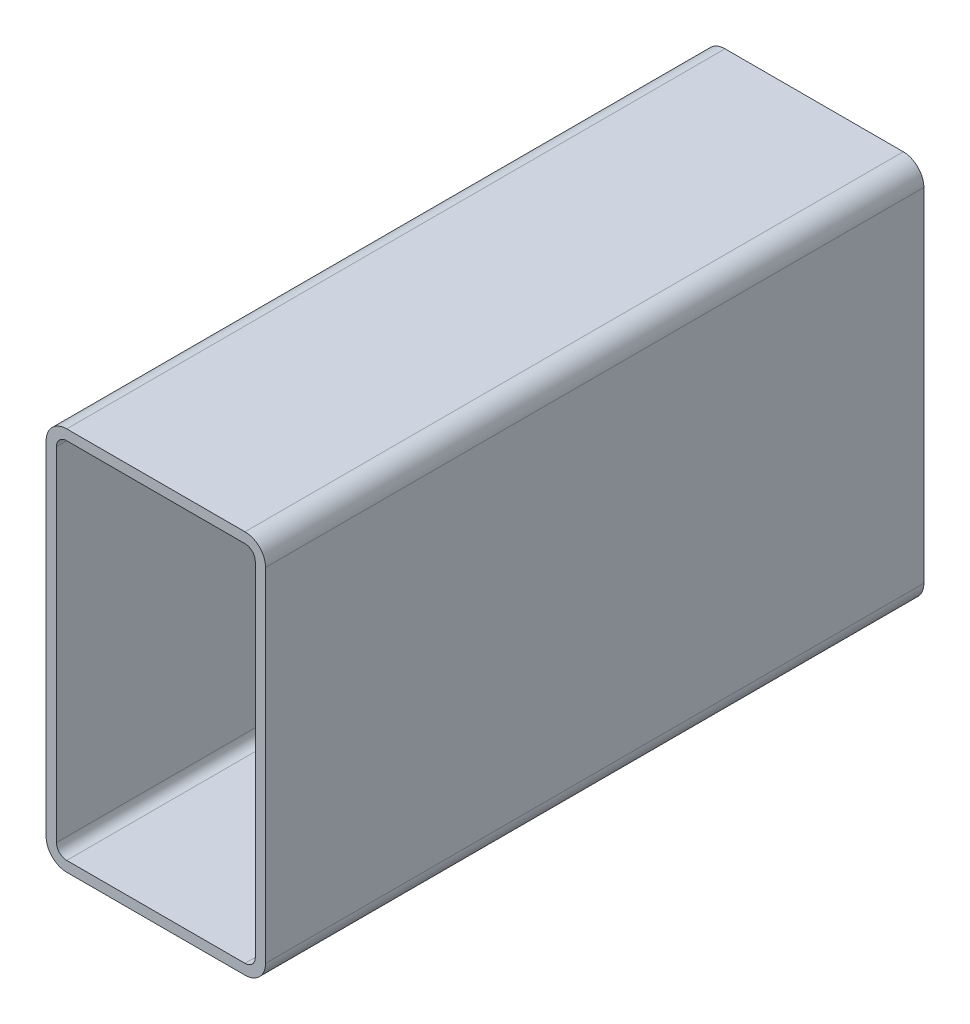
ISO-10303-21;
HEADER;
FILE_DESCRIPTION(('STEP AP214'),'2;1');
FILE_NAME('part.step','',(''),(''),'','','');
FILE_SCHEMA(('AUTOMOTIVE_DESIGN { 1 0 10303 214 1 1 1 1 }'));
ENDSEC;
DATA;
#1=APPLICATION_CONTEXT('core data for automotive mechanical design processes');
#2=APPLICATION_PROTOCOL_DEFINITION('international standard','automotive_design',2000,#1);
#3=PRODUCT_CONTEXT('',#1,'mechanical');
#4=PRODUCT('Part','Part','',(#3));
#5=PRODUCT_RELATED_PRODUCT_CATEGORY('part','',(#4));
#6=PRODUCT_DEFINITION_FORMATION('','',#4);
#7=PRODUCT_DEFINITION_CONTEXT('part definition',#1,'design');
#8=PRODUCT_DEFINITION('design','',#6,#7);
#9=PRODUCT_DEFINITION_SHAPE('','',#8);
#10=(LENGTH_UNIT() NAMED_UNIT(*) SI_UNIT(.MILLI.,.METRE.));
#11=(NAMED_UNIT(*) PLANE_ANGLE_UNIT() SI_UNIT($,.RADIAN.));
#12=(NAMED_UNIT(*) SI_UNIT($,.STERADIAN.) SOLID_ANGLE_UNIT());
#13=UNCERTAINTY_MEASURE_WITH_UNIT(LENGTH_MEASURE(1.E-05),#10,'distance_accuracy_value','');
#14=(GEOMETRIC_REPRESENTATION_CONTEXT(3) GLOBAL_UNCERTAINTY_ASSIGNED_CONTEXT((#13)) GLOBAL_UNIT_ASSIGNED_CONTEXT((#10,
#11,#12)) REPRESENTATION_CONTEXT('',''));
#15=CARTESIAN_POINT('',(0.,0.,0.));
#16=DIRECTION('',(0.,0.,1.));
#17=DIRECTION('',(1.,0.,0.));
#18=AXIS2_PLACEMENT_3D('',#15,#16,#17);
#19=CARTESIAN_POINT('',(11.2001778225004,170.264039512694,304.8));
#20=DIRECTION('',(0.,0.,1.));
#21=DIRECTION('',(1.,0.,0.));
#22=AXIS2_PLACEMENT_3D('',#19,#20,#21);
#23=PLANE('',#22);
#24=CARTESIAN_POINT('',(11.2001778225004,170.264039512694,304.8));
#25=DIRECTION('',(0.,0.,1.));
#26=DIRECTION('',(1.,0.,0.));
#27=AXIS2_PLACEMENT_3D('',#24,#25,#26);
#28=CIRCLE('',#27,9.525);
#29=CARTESIAN_POINT('',(11.2001778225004,179.789039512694,304.8));
#30=VERTEX_POINT('',#29);
#31=CARTESIAN_POINT('',(1.67517782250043,170.264039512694,304.8));
#32=VERTEX_POINT('',#31);
#33=EDGE_CURVE('E211',#30,#32,#28,.T.);
#34=ORIENTED_EDGE('',*,*,#33,.T.);
#35=DIRECTION('',(0.,-1.,0.));
#36=VECTOR('',#35,1.);
#37=CARTESIAN_POINT('',(1.67517782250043,11.5140395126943,304.8));
#38=LINE('',#37,#36);
#39=CARTESIAN_POINT('',(1.67517782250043,11.5140395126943,304.8));
#40=VERTEX_POINT('',#39);
#41=EDGE_CURVE('E214',#32,#40,#38,.T.);
#42=ORIENTED_EDGE('',*,*,#41,.T.);
#43=CARTESIAN_POINT('',(11.2001778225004,11.5140395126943,304.8));
#44=DIRECTION('',(0.,0.,1.));
#45=DIRECTION('',(1.,0.,0.));
#46=AXIS2_PLACEMENT_3D('',#43,#44,#45);
#47=CIRCLE('',#46,9.525);
#48=CARTESIAN_POINT('',(11.2001778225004,1.98903951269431,304.8));
#49=VERTEX_POINT('',#48);
#50=EDGE_CURVE('E217',#40,#49,#47,.T.);
#51=ORIENTED_EDGE('',*,*,#50,.T.);
#52=DIRECTION('',(1.,0.,0.));
#53=VECTOR('',#52,1.);
#54=CARTESIAN_POINT('',(93.7501778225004,1.98903951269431,304.8));
#55=LINE('',#54,#53);
#56=CARTESIAN_POINT('',(93.7501778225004,1.98903951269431,304.8));
#57=VERTEX_POINT('',#56);
#58=EDGE_CURVE('E219',#49,#57,#55,.T.);
#59=ORIENTED_EDGE('',*,*,#58,.T.);
#60=CARTESIAN_POINT('',(93.7501778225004,11.5140395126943,304.8));
#61=DIRECTION('',(0.,0.,1.));
#62=DIRECTION('',(1.,0.,0.));
#63=AXIS2_PLACEMENT_3D('',#60,#61,#62);
#64=CIRCLE('',#63,9.52500000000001);
#65=CARTESIAN_POINT('',(103.2751778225,11.5140395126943,304.8));
#66=VERTEX_POINT('',#65);
#67=EDGE_CURVE('E221',#57,#66,#64,.T.);
#68=ORIENTED_EDGE('',*,*,#67,.T.);
#69=DIRECTION('',(0.,1.,0.));
#70=VECTOR('',#69,1.);
#71=CARTESIAN_POINT('',(103.2751778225,170.264039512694,304.8));
#72=LINE('',#71,#70);
#73=CARTESIAN_POINT('',(103.2751778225,170.264039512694,304.8));
#74=VERTEX_POINT('',#73);
#75=EDGE_CURVE('E223',#66,#74,#72,.T.);
#76=ORIENTED_EDGE('',*,*,#75,.T.);
#77=CARTESIAN_POINT('',(93.7501778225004,170.264039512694,304.8));
#78=DIRECTION('',(0.,0.,1.));
#79=DIRECTION('',(1.,0.,0.));
#80=AXIS2_PLACEMENT_3D('',#77,#78,#79);
#81=CIRCLE('',#80,9.525);
#82=CARTESIAN_POINT('',(93.7501778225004,179.789039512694,304.8));
#83=VERTEX_POINT('',#82);
#84=EDGE_CURVE('E225',#74,#83,#81,.T.);
#85=ORIENTED_EDGE('',*,*,#84,.T.);
#86=DIRECTION('',(-1.,0.,0.));
#87=VECTOR('',#86,1.);
#88=CARTESIAN_POINT('',(11.2001778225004,179.789039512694,304.8));
#89=LINE('',#88,#87);
#90=EDGE_CURVE('E227',#83,#30,#89,.T.);
#91=ORIENTED_EDGE('',*,*,#90,.T.);
#92=EDGE_LOOP('',(#34,#42,#51,#59,#68,#76,#85,#91));
#93=FACE_BOUND('',#92,.T.);
#94=DIRECTION('',(0.,-1.,0.));
#95=VECTOR('',#94,1.);
#96=CARTESIAN_POINT('',(6.43767782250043,11.5140395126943,304.8));
#97=LINE('',#96,#95);
#98=CARTESIAN_POINT('',(6.43767782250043,170.264039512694,304.8));
#99=VERTEX_POINT('',#98);
#100=CARTESIAN_POINT('',(6.43767782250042,11.5140395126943,304.8));
#101=VERTEX_POINT('',#100);
#102=EDGE_CURVE('E154',#99,#101,#97,.T.);
#103=ORIENTED_EDGE('',*,*,#102,.F.);
#104=CARTESIAN_POINT('',(11.2001778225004,170.264039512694,304.8));
#105=DIRECTION('',(0.,0.,1.));
#106=DIRECTION('',(1.,0.,0.));
#107=AXIS2_PLACEMENT_3D('',#104,#105,#106);
#108=CIRCLE('',#107,4.7625);
#109=CARTESIAN_POINT('',(11.2001778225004,175.026539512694,304.8));
#110=VERTEX_POINT('',#109);
#111=EDGE_CURVE('E146',#110,#99,#108,.T.);
#112=ORIENTED_EDGE('',*,*,#111,.F.);
#113=DIRECTION('',(-1.,0.,0.));
#114=VECTOR('',#113,1.);
#115=CARTESIAN_POINT('',(11.2001778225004,175.026539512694,304.8));
#116=LINE('',#115,#114);
#117=CARTESIAN_POINT('',(93.7501778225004,175.026539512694,304.8));
#118=VERTEX_POINT('',#117);
#119=EDGE_CURVE('E179',#118,#110,#116,.T.);
#120=ORIENTED_EDGE('',*,*,#119,.F.);
#121=CARTESIAN_POINT('',(93.7501778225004,170.264039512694,304.8));
#122=DIRECTION('',(0.,0.,1.));
#123=DIRECTION('',(1.,0.,0.));
#124=AXIS2_PLACEMENT_3D('',#121,#122,#123);
#125=CIRCLE('',#124,4.7625);
#126=CARTESIAN_POINT('',(98.5126778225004,170.264039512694,304.8));
#127=VERTEX_POINT('',#126);
#128=EDGE_CURVE('E177',#127,#118,#125,.T.);
#129=ORIENTED_EDGE('',*,*,#128,.F.);
#130=DIRECTION('',(0.,1.,0.));
#131=VECTOR('',#130,1.);
#132=CARTESIAN_POINT('',(98.5126778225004,170.264039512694,304.8));
#133=LINE('',#132,#131);
#134=CARTESIAN_POINT('',(98.5126778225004,11.5140395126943,304.8));
#135=VERTEX_POINT('',#134);
#136=EDGE_CURVE('E175',#135,#127,#133,.T.);
#137=ORIENTED_EDGE('',*,*,#136,.F.);
#138=CARTESIAN_POINT('',(93.7501778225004,11.5140395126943,304.8));
#139=DIRECTION('',(0.,0.,1.));
#140=DIRECTION('',(1.,0.,0.));
#141=AXIS2_PLACEMENT_3D('',#138,#139,#140);
#142=CIRCLE('',#141,4.7625);
#143=CARTESIAN_POINT('',(93.7501778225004,6.75153951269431,304.8));
#144=VERTEX_POINT('',#143);
#145=EDGE_CURVE('E173',#144,#135,#142,.T.);
#146=ORIENTED_EDGE('',*,*,#145,.F.);
#147=DIRECTION('',(1.,0.,0.));
#148=VECTOR('',#147,1.);
#149=CARTESIAN_POINT('',(93.7501778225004,6.75153951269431,304.8));
#150=LINE('',#149,#148);
#151=CARTESIAN_POINT('',(11.2001778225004,6.75153951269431,304.8));
#152=VERTEX_POINT('',#151);
#153=EDGE_CURVE('E169',#152,#144,#150,.T.);
#154=ORIENTED_EDGE('',*,*,#153,.F.);
#155=CARTESIAN_POINT('',(11.2001778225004,11.5140395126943,304.8));
#156=DIRECTION('',(0.,0.,1.));
#157=DIRECTION('',(1.,0.,0.));
#158=AXIS2_PLACEMENT_3D('',#155,#156,#157);
#159=CIRCLE('',#158,4.7625);
#160=EDGE_CURVE('E167',#101,#152,#159,.T.);
#161=ORIENTED_EDGE('',*,*,#160,.F.);
#162=EDGE_LOOP('',(#103,#112,#120,#129,#137,#146,#154,#161));
#163=FACE_BOUND('',#162,.T.);
#164=ADVANCED_FACE('F33',(#93,#163),#23,.T.);
#165=CARTESIAN_POINT('',(11.2001778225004,170.264039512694,0.));
#166=DIRECTION('',(0.,0.,1.));
#167=DIRECTION('',(1.,0.,0.));
#168=AXIS2_PLACEMENT_3D('',#165,#166,#167);
#169=PLANE('',#168);
#170=CARTESIAN_POINT('',(11.2001778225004,170.264039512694,0.));
#171=DIRECTION('',(0.,0.,1.));
#172=DIRECTION('',(1.,0.,0.));
#173=AXIS2_PLACEMENT_3D('',#170,#171,#172);
#174=CIRCLE('',#173,9.525);
#175=CARTESIAN_POINT('',(11.2001778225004,179.789039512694,0.));
#176=VERTEX_POINT('',#175);
#177=CARTESIAN_POINT('',(1.67517782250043,170.264039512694,0.));
#178=VERTEX_POINT('',#177);
#179=EDGE_CURVE('E162',#176,#178,#174,.T.);
#180=ORIENTED_EDGE('',*,*,#179,.F.);
#181=DIRECTION('',(-1.,0.,0.));
#182=VECTOR('',#181,1.);
#183=CARTESIAN_POINT('',(11.2001778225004,179.789039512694,0.));
#184=LINE('',#183,#182);
#185=CARTESIAN_POINT('',(93.7501778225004,179.789039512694,0.));
#186=VERTEX_POINT('',#185);
#187=EDGE_CURVE('E215',#186,#176,#184,.T.);
#188=ORIENTED_EDGE('',*,*,#187,.F.);
#189=CARTESIAN_POINT('',(93.7501778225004,170.264039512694,0.));
#190=DIRECTION('',(0.,0.,1.));
#191=DIRECTION('',(1.,0.,0.));
#192=AXIS2_PLACEMENT_3D('',#189,#190,#191);
#193=CIRCLE('',#192,9.525);
#194=CARTESIAN_POINT('',(103.2751778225,170.264039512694,0.));
#195=VERTEX_POINT('',#194);
#196=EDGE_CURVE('E242',#195,#186,#193,.T.);
#197=ORIENTED_EDGE('',*,*,#196,.F.);
#198=DIRECTION('',(0.,1.,0.));
#199=VECTOR('',#198,1.);
#200=CARTESIAN_POINT('',(103.2751778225,170.264039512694,0.));
#201=LINE('',#200,#199);
#202=CARTESIAN_POINT('',(103.2751778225,11.5140395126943,0.));
#203=VERTEX_POINT('',#202);
#204=EDGE_CURVE('E240',#203,#195,#201,.T.);
#205=ORIENTED_EDGE('',*,*,#204,.F.);
#206=CARTESIAN_POINT('',(93.7501778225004,11.5140395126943,0.));
#207=DIRECTION('',(0.,0.,1.));
#208=DIRECTION('',(1.,0.,0.));
#209=AXIS2_PLACEMENT_3D('',#206,#207,#208);
#210=CIRCLE('',#209,9.52500000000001);
#211=CARTESIAN_POINT('',(93.7501778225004,1.98903951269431,0.));
#212=VERTEX_POINT('',#211);
#213=EDGE_CURVE('E238',#212,#203,#210,.T.);
#214=ORIENTED_EDGE('',*,*,#213,.F.);
#215=DIRECTION('',(1.,0.,0.));
#216=VECTOR('',#215,1.);
#217=CARTESIAN_POINT('',(93.7501778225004,1.98903951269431,0.));
#218=LINE('',#217,#216);
#219=CARTESIAN_POINT('',(11.2001778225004,1.98903951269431,0.));
#220=VERTEX_POINT('',#219);
#221=EDGE_CURVE('E236',#220,#212,#218,.T.);
#222=ORIENTED_EDGE('',*,*,#221,.F.);
#223=CARTESIAN_POINT('',(11.2001778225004,11.5140395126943,0.));
#224=DIRECTION('',(0.,0.,1.));
#225=DIRECTION('',(1.,0.,0.));
#226=AXIS2_PLACEMENT_3D('',#223,#224,#225);
#227=CIRCLE('',#226,9.525);
#228=CARTESIAN_POINT('',(1.67517782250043,11.5140395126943,0.));
#229=VERTEX_POINT('',#228);
#230=EDGE_CURVE('E234',#229,#220,#227,.T.);
#231=ORIENTED_EDGE('',*,*,#230,.F.);
#232=DIRECTION('',(0.,-1.,0.));
#233=VECTOR('',#232,1.);
#234=CARTESIAN_POINT('',(1.67517782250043,11.5140395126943,0.));
#235=LINE('',#234,#233);
#236=EDGE_CURVE('E232',#178,#229,#235,.T.);
#237=ORIENTED_EDGE('',*,*,#236,.F.);
#238=EDGE_LOOP('',(#180,#188,#197,#205,#214,#222,#231,#237));
#239=FACE_BOUND('',#238,.T.);
#240=CARTESIAN_POINT('',(11.2001778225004,170.264039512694,0.));
#241=DIRECTION('',(0.,0.,1.));
#242=DIRECTION('',(1.,0.,0.));
#243=AXIS2_PLACEMENT_3D('',#240,#241,#242);
#244=CIRCLE('',#243,4.7625);
#245=CARTESIAN_POINT('',(11.2001778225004,175.026539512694,0.));
#246=VERTEX_POINT('',#245);
#247=CARTESIAN_POINT('',(6.43767782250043,170.264039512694,0.));
#248=VERTEX_POINT('',#247);
#249=EDGE_CURVE('E56',#246,#248,#244,.T.);
#250=ORIENTED_EDGE('',*,*,#249,.T.);
#251=DIRECTION('',(0.,-1.,0.));
#252=VECTOR('',#251,1.);
#253=CARTESIAN_POINT('',(6.43767782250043,11.5140395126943,0.));
#254=LINE('',#253,#252);
#255=CARTESIAN_POINT('',(6.43767782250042,11.5140395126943,0.));
#256=VERTEX_POINT('',#255);
#257=EDGE_CURVE('E161',#248,#256,#254,.T.);
#258=ORIENTED_EDGE('',*,*,#257,.T.);
#259=CARTESIAN_POINT('',(11.2001778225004,11.5140395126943,0.));
#260=DIRECTION('',(0.,0.,1.));
#261=DIRECTION('',(1.,0.,0.));
#262=AXIS2_PLACEMENT_3D('',#259,#260,#261);
#263=CIRCLE('',#262,4.7625);
#264=CARTESIAN_POINT('',(11.2001778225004,6.75153951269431,0.));
#265=VERTEX_POINT('',#264);
#266=EDGE_CURVE('E183',#256,#265,#263,.T.);
#267=ORIENTED_EDGE('',*,*,#266,.T.);
#268=DIRECTION('',(1.,0.,0.));
#269=VECTOR('',#268,1.);
#270=CARTESIAN_POINT('',(93.7501778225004,6.75153951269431,0.));
#271=LINE('',#270,#269);
#272=CARTESIAN_POINT('',(93.7501778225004,6.75153951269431,0.));
#273=VERTEX_POINT('',#272);
#274=EDGE_CURVE('E186',#265,#273,#271,.T.);
#275=ORIENTED_EDGE('',*,*,#274,.T.);
#276=CARTESIAN_POINT('',(93.7501778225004,11.5140395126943,0.));
#277=DIRECTION('',(0.,0.,1.));
#278=DIRECTION('',(1.,0.,0.));
#279=AXIS2_PLACEMENT_3D('',#276,#277,#278);
#280=CIRCLE('',#279,4.7625);
#281=CARTESIAN_POINT('',(98.5126778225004,11.5140395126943,0.));
#282=VERTEX_POINT('',#281);
#283=EDGE_CURVE('E189',#273,#282,#280,.T.);
#284=ORIENTED_EDGE('',*,*,#283,.T.);
#285=DIRECTION('',(0.,1.,0.));
#286=VECTOR('',#285,1.);
#287=CARTESIAN_POINT('',(98.5126778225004,170.264039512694,0.));
#288=LINE('',#287,#286);
#289=CARTESIAN_POINT('',(98.5126778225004,170.264039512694,0.));
#290=VERTEX_POINT('',#289);
#291=EDGE_CURVE('E192',#282,#290,#288,.T.);
#292=ORIENTED_EDGE('',*,*,#291,.T.);
#293=CARTESIAN_POINT('',(93.7501778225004,170.264039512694,0.));
#294=DIRECTION('',(0.,0.,1.));
#295=DIRECTION('',(1.,0.,0.));
#296=AXIS2_PLACEMENT_3D('',#293,#294,#295);
#297=CIRCLE('',#296,4.7625);
#298=CARTESIAN_POINT('',(93.7501778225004,175.026539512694,0.));
#299=VERTEX_POINT('',#298);
#300=EDGE_CURVE('E195',#290,#299,#297,.T.);
#301=ORIENTED_EDGE('',*,*,#300,.T.);
#302=DIRECTION('',(-1.,0.,0.));
#303=VECTOR('',#302,1.);
#304=CARTESIAN_POINT('',(11.2001778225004,175.026539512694,0.));
#305=LINE('',#304,#303);
#306=EDGE_CURVE('E155',#299,#246,#305,.T.);
#307=ORIENTED_EDGE('',*,*,#306,.T.);
#308=EDGE_LOOP('',(#250,#258,#267,#275,#284,#292,#301,#307));
#309=FACE_BOUND('',#308,.T.);
#310=ADVANCED_FACE('F272',(#239,#309),#169,.F.);
#311=CARTESIAN_POINT('',(11.2001778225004,170.264039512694,304.8));
#312=DIRECTION('',(0.,0.,-1.));
#313=DIRECTION('',(-1.,0.,0.));
#314=AXIS2_PLACEMENT_3D('',#311,#312,#313);
#315=CYLINDRICAL_SURFACE('',#314,9.525);
#316=ORIENTED_EDGE('',*,*,#179,.T.);
#317=DIRECTION('',(0.,0.,-1.));
#318=VECTOR('',#317,1.);
#319=CARTESIAN_POINT('',(1.67517782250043,170.264039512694,304.8));
#320=LINE('',#319,#318);
#321=EDGE_CURVE('E11',#32,#178,#320,.T.);
#322=ORIENTED_EDGE('',*,*,#321,.F.);
#323=ORIENTED_EDGE('',*,*,#33,.F.);
#324=DIRECTION('',(0.,0.,-1.));
#325=VECTOR('',#324,1.);
#326=CARTESIAN_POINT('',(11.2001778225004,179.789039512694,304.8));
#327=LINE('',#326,#325);
#328=EDGE_CURVE('E229',#30,#176,#327,.T.);
#329=ORIENTED_EDGE('',*,*,#328,.T.);
#330=EDGE_LOOP('',(#316,#322,#323,#329));
#331=FACE_BOUND('',#330,.T.);
#332=ADVANCED_FACE('F35',(#331),#315,.T.);
#333=CARTESIAN_POINT('',(1.67517782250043,11.5140395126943,304.8));
#334=DIRECTION('',(1.,0.,0.));
#335=DIRECTION('',(0.,0.,-1.));
#336=AXIS2_PLACEMENT_3D('',#333,#334,#335);
#337=PLANE('',#336);
#338=ORIENTED_EDGE('',*,*,#236,.T.);
#339=DIRECTION('',(0.,0.,-1.));
#340=VECTOR('',#339,1.);
#341=CARTESIAN_POINT('',(1.67517782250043,11.5140395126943,304.8));
#342=LINE('',#341,#340);
#343=EDGE_CURVE('E41',#40,#229,#342,.T.);
#344=ORIENTED_EDGE('',*,*,#343,.F.);
#345=ORIENTED_EDGE('',*,*,#41,.F.);
#346=ORIENTED_EDGE('',*,*,#321,.T.);
#347=EDGE_LOOP('',(#338,#344,#345,#346));
#348=FACE_BOUND('',#347,.T.);
#349=ADVANCED_FACE('F289',(#348),#337,.F.);
#350=CARTESIAN_POINT('',(11.2001778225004,11.5140395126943,304.8));
#351=DIRECTION('',(0.,0.,-1.));
#352=DIRECTION('',(-1.,0.,0.));
#353=AXIS2_PLACEMENT_3D('',#350,#351,#352);
#354=CYLINDRICAL_SURFACE('',#353,9.525);
#355=ORIENTED_EDGE('',*,*,#230,.T.);
#356=DIRECTION('',(0.,0.,-1.));
#357=VECTOR('',#356,1.);
#358=CARTESIAN_POINT('',(11.2001778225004,1.98903951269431,304.8));
#359=LINE('',#358,#357);
#360=EDGE_CURVE('E259',#49,#220,#359,.T.);
#361=ORIENTED_EDGE('',*,*,#360,.F.);
#362=ORIENTED_EDGE('',*,*,#50,.F.);
#363=ORIENTED_EDGE('',*,*,#343,.T.);
#364=EDGE_LOOP('',(#355,#361,#362,#363));
#365=FACE_BOUND('',#364,.T.);
#366=ADVANCED_FACE('F266',(#365),#354,.T.);
#367=CARTESIAN_POINT('',(93.7501778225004,1.98903951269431,304.8));
#368=DIRECTION('',(0.,1.,0.));
#369=DIRECTION('',(0.,0.,1.));
#370=AXIS2_PLACEMENT_3D('',#367,#368,#369);
#371=PLANE('',#370);
#372=ORIENTED_EDGE('',*,*,#221,.T.);
#373=DIRECTION('',(0.,0.,-1.));
#374=VECTOR('',#373,1.);
#375=CARTESIAN_POINT('',(93.7501778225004,1.98903951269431,304.8));
#376=LINE('',#375,#374);
#377=EDGE_CURVE('E256',#57,#212,#376,.T.);
#378=ORIENTED_EDGE('',*,*,#377,.F.);
#379=ORIENTED_EDGE('',*,*,#58,.F.);
#380=ORIENTED_EDGE('',*,*,#360,.T.);
#381=EDGE_LOOP('',(#372,#378,#379,#380));
#382=FACE_BOUND('',#381,.T.);
#383=ADVANCED_FACE('F278',(#382),#371,.F.);
#384=CARTESIAN_POINT('',(93.7501778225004,11.5140395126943,304.8));
#385=DIRECTION('',(0.,0.,-1.));
#386=DIRECTION('',(-1.,0.,0.));
#387=AXIS2_PLACEMENT_3D('',#384,#385,#386);
#388=CYLINDRICAL_SURFACE('',#387,9.52500000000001);
#389=ORIENTED_EDGE('',*,*,#213,.T.);
#390=DIRECTION('',(0.,0.,-1.));
#391=VECTOR('',#390,1.);
#392=CARTESIAN_POINT('',(103.2751778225,11.5140395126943,304.8));
#393=LINE('',#392,#391);
#394=EDGE_CURVE('E253',#66,#203,#393,.T.);
#395=ORIENTED_EDGE('',*,*,#394,.F.);
#396=ORIENTED_EDGE('',*,*,#67,.F.);
#397=ORIENTED_EDGE('',*,*,#377,.T.);
#398=EDGE_LOOP('',(#389,#395,#396,#397));
#399=FACE_BOUND('',#398,.T.);
#400=ADVANCED_FACE('F282',(#399),#388,.T.);
#401=CARTESIAN_POINT('',(103.2751778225,170.264039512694,304.8));
#402=DIRECTION('',(-1.,0.,0.));
#403=DIRECTION('',(0.,0.,1.));
#404=AXIS2_PLACEMENT_3D('',#401,#402,#403);
#405=PLANE('',#404);
#406=ORIENTED_EDGE('',*,*,#204,.T.);
#407=DIRECTION('',(0.,0.,-1.));
#408=VECTOR('',#407,1.);
#409=CARTESIAN_POINT('',(103.2751778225,170.264039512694,304.8));
#410=LINE('',#409,#408);
#411=EDGE_CURVE('E250',#74,#195,#410,.T.);
#412=ORIENTED_EDGE('',*,*,#411,.F.);
#413=ORIENTED_EDGE('',*,*,#75,.F.);
#414=ORIENTED_EDGE('',*,*,#394,.T.);
#415=EDGE_LOOP('',(#406,#412,#413,#414));
#416=FACE_BOUND('',#415,.T.);
#417=ADVANCED_FACE('F302',(#416),#405,.F.);
#418=CARTESIAN_POINT('',(93.7501778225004,170.264039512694,304.8));
#419=DIRECTION('',(0.,0.,-1.));
#420=DIRECTION('',(-1.,0.,0.));
#421=AXIS2_PLACEMENT_3D('',#418,#419,#420);
#422=CYLINDRICAL_SURFACE('',#421,9.525);
#423=ORIENTED_EDGE('',*,*,#196,.T.);
#424=DIRECTION('',(0.,0.,-1.));
#425=VECTOR('',#424,1.);
#426=CARTESIAN_POINT('',(93.7501778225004,179.789039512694,304.8));
#427=LINE('',#426,#425);
#428=EDGE_CURVE('E247',#83,#186,#427,.T.);
#429=ORIENTED_EDGE('',*,*,#428,.F.);
#430=ORIENTED_EDGE('',*,*,#84,.F.);
#431=ORIENTED_EDGE('',*,*,#411,.T.);
#432=EDGE_LOOP('',(#423,#429,#430,#431));
#433=FACE_BOUND('',#432,.T.);
#434=ADVANCED_FACE('F300',(#433),#422,.T.);
#435=CARTESIAN_POINT('',(11.2001778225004,179.789039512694,304.8));
#436=DIRECTION('',(0.,-1.,0.));
#437=DIRECTION('',(0.,0.,-1.));
#438=AXIS2_PLACEMENT_3D('',#435,#436,#437);
#439=PLANE('',#438);
#440=ORIENTED_EDGE('',*,*,#187,.T.);
#441=ORIENTED_EDGE('',*,*,#328,.F.);
#442=ORIENTED_EDGE('',*,*,#90,.F.);
#443=ORIENTED_EDGE('',*,*,#428,.T.);
#444=EDGE_LOOP('',(#440,#441,#442,#443));
#445=FACE_BOUND('',#444,.T.);
#446=ADVANCED_FACE('F295',(#445),#439,.F.);
#447=CARTESIAN_POINT('',(11.2001778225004,170.264039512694,304.8));
#448=DIRECTION('',(0.,0.,-1.));
#449=DIRECTION('',(-1.,0.,0.));
#450=AXIS2_PLACEMENT_3D('',#447,#448,#449);
#451=CYLINDRICAL_SURFACE('',#450,4.7625);
#452=ORIENTED_EDGE('',*,*,#249,.F.);
#453=DIRECTION('',(0.,0.,-1.));
#454=VECTOR('',#453,1.);
#455=CARTESIAN_POINT('',(11.2001778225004,175.026539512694,304.8));
#456=LINE('',#455,#454);
#457=EDGE_CURVE('E150',#110,#246,#456,.T.);
#458=ORIENTED_EDGE('',*,*,#457,.F.);
#459=ORIENTED_EDGE('',*,*,#111,.T.);
#460=DIRECTION('',(0.,0.,-1.));
#461=VECTOR('',#460,1.);
#462=CARTESIAN_POINT('',(6.43767782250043,170.264039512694,304.8));
#463=LINE('',#462,#461);
#464=EDGE_CURVE('E149',#99,#248,#463,.T.);
#465=ORIENTED_EDGE('',*,*,#464,.T.);
#466=EDGE_LOOP('',(#452,#458,#459,#465));
#467=FACE_BOUND('',#466,.T.);
#468=ADVANCED_FACE('F148',(#467),#451,.F.);
#469=CARTESIAN_POINT('',(6.43767782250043,11.5140395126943,304.8));
#470=DIRECTION('',(1.,0.,0.));
#471=DIRECTION('',(0.,0.,-1.));
#472=AXIS2_PLACEMENT_3D('',#469,#470,#471);
#473=PLANE('',#472);
#474=ORIENTED_EDGE('',*,*,#257,.F.);
#475=ORIENTED_EDGE('',*,*,#464,.F.);
#476=ORIENTED_EDGE('',*,*,#102,.T.);
#477=DIRECTION('',(0.,0.,-1.));
#478=VECTOR('',#477,1.);
#479=CARTESIAN_POINT('',(6.43767782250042,11.5140395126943,304.8));
#480=LINE('',#479,#478);
#481=EDGE_CURVE('E163',#101,#256,#480,.T.);
#482=ORIENTED_EDGE('',*,*,#481,.T.);
#483=EDGE_LOOP('',(#474,#475,#476,#482));
#484=FACE_BOUND('',#483,.T.);
#485=ADVANCED_FACE('F158',(#484),#473,.T.);
#486=CARTESIAN_POINT('',(11.2001778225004,11.5140395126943,304.8));
#487=DIRECTION('',(0.,0.,-1.));
#488=DIRECTION('',(-1.,0.,0.));
#489=AXIS2_PLACEMENT_3D('',#486,#487,#488);
#490=CYLINDRICAL_SURFACE('',#489,4.7625);
#491=ORIENTED_EDGE('',*,*,#266,.F.);
#492=ORIENTED_EDGE('',*,*,#481,.F.);
#493=ORIENTED_EDGE('',*,*,#160,.T.);
#494=DIRECTION('',(0.,0.,-1.));
#495=VECTOR('',#494,1.);
#496=CARTESIAN_POINT('',(11.2001778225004,6.75153951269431,304.8));
#497=LINE('',#496,#495);
#498=EDGE_CURVE('E208',#152,#265,#497,.T.);
#499=ORIENTED_EDGE('',*,*,#498,.T.);
#500=EDGE_LOOP('',(#491,#492,#493,#499));
#501=FACE_BOUND('',#500,.T.);
#502=ADVANCED_FACE('F327',(#501),#490,.F.);
#503=CARTESIAN_POINT('',(93.7501778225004,6.75153951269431,304.8));
#504=DIRECTION('',(0.,1.,0.));
#505=DIRECTION('',(0.,0.,1.));
#506=AXIS2_PLACEMENT_3D('',#503,#504,#505);
#507=PLANE('',#506);
#508=ORIENTED_EDGE('',*,*,#274,.F.);
#509=ORIENTED_EDGE('',*,*,#498,.F.);
#510=ORIENTED_EDGE('',*,*,#153,.T.);
#511=DIRECTION('',(0.,0.,-1.));
#512=VECTOR('',#511,1.);
#513=CARTESIAN_POINT('',(93.7501778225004,6.75153951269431,304.8));
#514=LINE('',#513,#512);
#515=EDGE_CURVE('E206',#144,#273,#514,.T.);
#516=ORIENTED_EDGE('',*,*,#515,.T.);
#517=EDGE_LOOP('',(#508,#509,#510,#516));
#518=FACE_BOUND('',#517,.T.);
#519=ADVANCED_FACE('F331',(#518),#507,.T.);
#520=CARTESIAN_POINT('',(93.7501778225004,11.5140395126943,304.8));
#521=DIRECTION('',(0.,0.,-1.));
#522=DIRECTION('',(-1.,0.,0.));
#523=AXIS2_PLACEMENT_3D('',#520,#521,#522);
#524=CYLINDRICAL_SURFACE('',#523,4.7625);
#525=ORIENTED_EDGE('',*,*,#283,.F.);
#526=ORIENTED_EDGE('',*,*,#515,.F.);
#527=ORIENTED_EDGE('',*,*,#145,.T.);
#528=DIRECTION('',(0.,0.,-1.));
#529=VECTOR('',#528,1.);
#530=CARTESIAN_POINT('',(98.5126778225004,11.5140395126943,304.8));
#531=LINE('',#530,#529);
#532=EDGE_CURVE('E204',#135,#282,#531,.T.);
#533=ORIENTED_EDGE('',*,*,#532,.T.);
#534=EDGE_LOOP('',(#525,#526,#527,#533));
#535=FACE_BOUND('',#534,.T.);
#536=ADVANCED_FACE('F337',(#535),#524,.F.);
#537=CARTESIAN_POINT('',(98.5126778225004,170.264039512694,304.8));
#538=DIRECTION('',(-1.,0.,0.));
#539=DIRECTION('',(0.,0.,1.));
#540=AXIS2_PLACEMENT_3D('',#537,#538,#539);
#541=PLANE('',#540);
#542=ORIENTED_EDGE('',*,*,#291,.F.);
#543=ORIENTED_EDGE('',*,*,#532,.F.);
#544=ORIENTED_EDGE('',*,*,#136,.T.);
#545=DIRECTION('',(0.,0.,-1.));
#546=VECTOR('',#545,1.);
#547=CARTESIAN_POINT('',(98.5126778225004,170.264039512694,304.8));
#548=LINE('',#547,#546);
#549=EDGE_CURVE('E202',#127,#290,#548,.T.);
#550=ORIENTED_EDGE('',*,*,#549,.T.);
#551=EDGE_LOOP('',(#542,#543,#544,#550));
#552=FACE_BOUND('',#551,.T.);
#553=ADVANCED_FACE('F341',(#552),#541,.T.);
#554=CARTESIAN_POINT('',(93.7501778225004,170.264039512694,304.8));
#555=DIRECTION('',(0.,0.,-1.));
#556=DIRECTION('',(-1.,0.,0.));
#557=AXIS2_PLACEMENT_3D('',#554,#555,#556);
#558=CYLINDRICAL_SURFACE('',#557,4.7625);
#559=ORIENTED_EDGE('',*,*,#300,.F.);
#560=ORIENTED_EDGE('',*,*,#549,.F.);
#561=ORIENTED_EDGE('',*,*,#128,.T.);
#562=DIRECTION('',(0.,0.,-1.));
#563=VECTOR('',#562,1.);
#564=CARTESIAN_POINT('',(93.7501778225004,175.026539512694,304.8));
#565=LINE('',#564,#563);
#566=EDGE_CURVE('E48',#118,#299,#565,.T.);
#567=ORIENTED_EDGE('',*,*,#566,.T.);
#568=EDGE_LOOP('',(#559,#560,#561,#567));
#569=FACE_BOUND('',#568,.T.);
#570=ADVANCED_FACE('F345',(#569),#558,.F.);
#571=CARTESIAN_POINT('',(11.2001778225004,175.026539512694,304.8));
#572=DIRECTION('',(0.,-1.,0.));
#573=DIRECTION('',(0.,0.,-1.));
#574=AXIS2_PLACEMENT_3D('',#571,#572,#573);
#575=PLANE('',#574);
#576=ORIENTED_EDGE('',*,*,#306,.F.);
#577=ORIENTED_EDGE('',*,*,#566,.F.);
#578=ORIENTED_EDGE('',*,*,#119,.T.);
#579=ORIENTED_EDGE('',*,*,#457,.T.);
#580=EDGE_LOOP('',(#576,#577,#578,#579));
#581=FACE_BOUND('',#580,.T.);
#582=ADVANCED_FACE('F349',(#581),#575,.T.);
#583=CLOSED_SHELL('',(#164,#310,#332,#349,#366,#383,#400,#417,#434,#446,#468,#485,#502,#519,
#536,#553,#570,#582));
#584=MANIFOLD_SOLID_BREP('B2',#583);
#585=ADVANCED_BREP_SHAPE_REPRESENTATION('',(#18,#584),#14);
#586=SHAPE_DEFINITION_REPRESENTATION(#9,#585);
ENDSEC;
END-ISO-10303-21;
